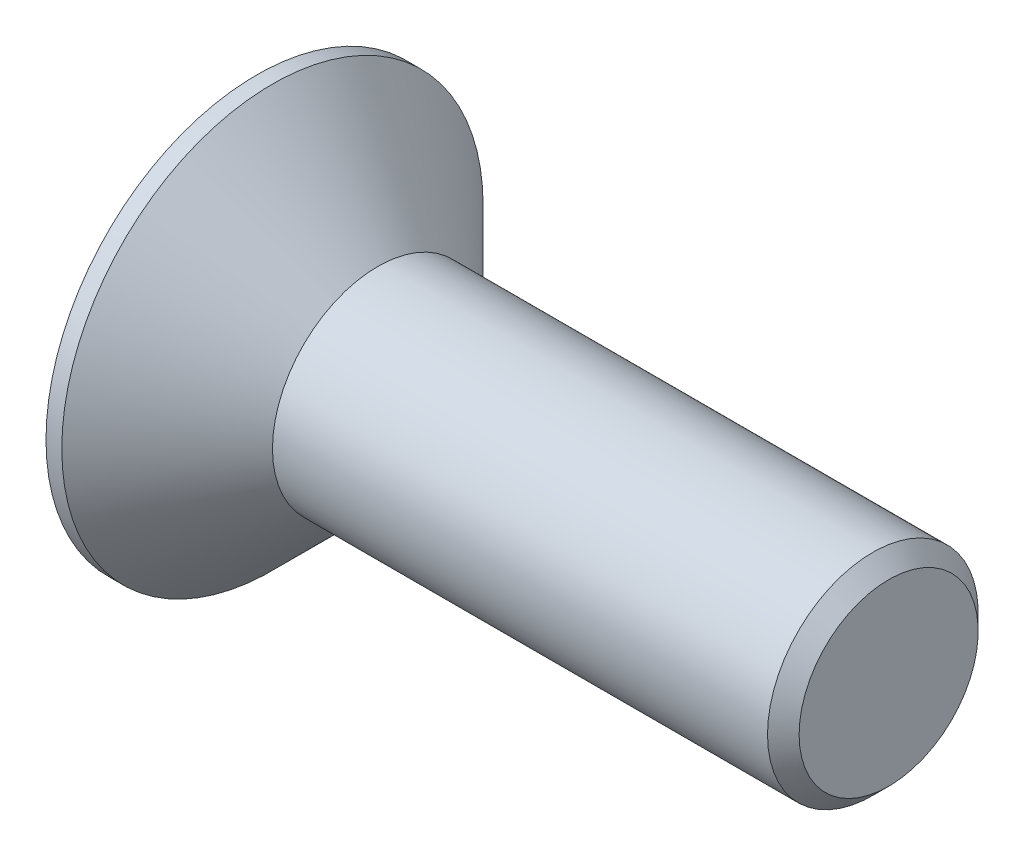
ISO-10303-21;
HEADER;
FILE_DESCRIPTION(('STEP AP214'),'2;1');
FILE_NAME('part.step','',(''),(''),'','','');
FILE_SCHEMA(('AUTOMOTIVE_DESIGN { 1 0 10303 214 1 1 1 1 }'));
ENDSEC;
DATA;
#1=APPLICATION_CONTEXT('core data for automotive mechanical design processes');
#2=APPLICATION_PROTOCOL_DEFINITION('international standard','automotive_design',2000,#1);
#3=PRODUCT_CONTEXT('',#1,'mechanical');
#4=PRODUCT('Part','Part','',(#3));
#5=PRODUCT_RELATED_PRODUCT_CATEGORY('part','',(#4));
#6=PRODUCT_DEFINITION_FORMATION('','',#4);
#7=PRODUCT_DEFINITION_CONTEXT('part definition',#1,'design');
#8=PRODUCT_DEFINITION('design','',#6,#7);
#9=PRODUCT_DEFINITION_SHAPE('','',#8);
#10=(LENGTH_UNIT() NAMED_UNIT(*) SI_UNIT(.MILLI.,.METRE.));
#11=(NAMED_UNIT(*) PLANE_ANGLE_UNIT() SI_UNIT($,.RADIAN.));
#12=(NAMED_UNIT(*) SI_UNIT($,.STERADIAN.) SOLID_ANGLE_UNIT());
#13=UNCERTAINTY_MEASURE_WITH_UNIT(LENGTH_MEASURE(1.E-05),#10,'distance_accuracy_value','');
#14=(GEOMETRIC_REPRESENTATION_CONTEXT(3) GLOBAL_UNCERTAINTY_ASSIGNED_CONTEXT((#13)) GLOBAL_UNIT_ASSIGNED_CONTEXT((#10,
#11,#12)) REPRESENTATION_CONTEXT('',''));
#15=CARTESIAN_POINT('',(0.,0.,0.));
#16=DIRECTION('',(0.,0.,1.));
#17=DIRECTION('',(1.,0.,0.));
#18=AXIS2_PLACEMENT_3D('',#15,#16,#17);
#19=CARTESIAN_POINT('',(-148.,44.,11.9999999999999));
#20=DIRECTION('',(-1.,0.,0.));
#21=DIRECTION('',(0.,0.,1.));
#22=AXIS2_PLACEMENT_3D('',#19,#20,#21);
#23=PLANE('',#22);
#24=CARTESIAN_POINT('',(-148.,44.,11.9999999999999));
#25=DIRECTION('',(-1.,0.,0.));
#26=DIRECTION('',(0.,0.,1.));
#27=AXIS2_PLACEMENT_3D('',#24,#25,#26);
#28=CIRCLE('',#27,4.);
#29=CARTESIAN_POINT('',(-148.,44.,15.9999999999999));
#30=VERTEX_POINT('',#29);
#31=EDGE_CURVE('E11',#30,#30,#28,.T.);
#32=ORIENTED_EDGE('',*,*,#31,.T.);
#33=EDGE_LOOP('',(#32));
#34=FACE_BOUND('',#33,.T.);
#35=DIRECTION('',(0.,0.,1.));
#36=VECTOR('',#35,1.);
#37=CARTESIAN_POINT('',(-148.,45.2499994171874,11.2783124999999));
#38=LINE('',#37,#36);
#39=CARTESIAN_POINT('',(-148.,45.2499994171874,11.2783124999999));
#40=VERTEX_POINT('',#39);
#41=CARTESIAN_POINT('',(-148.,45.2499994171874,12.7216874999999));
#42=VERTEX_POINT('',#41);
#43=EDGE_CURVE('E91',#40,#42,#38,.T.);
#44=ORIENTED_EDGE('',*,*,#43,.T.);
#45=DIRECTION('',(0.,-0.866025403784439,0.5));
#46=VECTOR('',#45,1.);
#47=CARTESIAN_POINT('',(-148.,45.2499994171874,12.7216874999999));
#48=LINE('',#47,#46);
#49=CARTESIAN_POINT('',(-148.,44.,13.4433749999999));
#50=VERTEX_POINT('',#49);
#51=EDGE_CURVE('E30',#42,#50,#48,.T.);
#52=ORIENTED_EDGE('',*,*,#51,.T.);
#53=DIRECTION('',(0.,-0.866025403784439,-0.5));
#54=VECTOR('',#53,1.);
#55=CARTESIAN_POINT('',(-148.,44.,13.4433749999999));
#56=LINE('',#55,#54);
#57=CARTESIAN_POINT('',(-148.,42.7500005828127,12.7216874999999));
#58=VERTEX_POINT('',#57);
#59=EDGE_CURVE('E168',#50,#58,#56,.T.);
#60=ORIENTED_EDGE('',*,*,#59,.T.);
#61=DIRECTION('',(0.,0.,-1.));
#62=VECTOR('',#61,1.);
#63=CARTESIAN_POINT('',(-148.,42.7500005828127,12.7216874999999));
#64=LINE('',#63,#62);
#65=CARTESIAN_POINT('',(-148.,42.7500005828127,11.2783124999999));
#66=VERTEX_POINT('',#65);
#67=EDGE_CURVE('E164',#58,#66,#64,.T.);
#68=ORIENTED_EDGE('',*,*,#67,.T.);
#69=DIRECTION('',(0.,0.866025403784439,-0.5));
#70=VECTOR('',#69,1.);
#71=CARTESIAN_POINT('',(-148.,42.7500005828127,11.2783124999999));
#72=LINE('',#71,#70);
#73=CARTESIAN_POINT('',(-148.,44.,10.5566249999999));
#74=VERTEX_POINT('',#73);
#75=EDGE_CURVE('E159',#66,#74,#72,.T.);
#76=ORIENTED_EDGE('',*,*,#75,.T.);
#77=DIRECTION('',(0.,0.866025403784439,0.5));
#78=VECTOR('',#77,1.);
#79=CARTESIAN_POINT('',(-148.,44.,10.5566249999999));
#80=LINE('',#79,#78);
#81=EDGE_CURVE('E95',#74,#40,#80,.T.);
#82=ORIENTED_EDGE('',*,*,#81,.T.);
#83=EDGE_LOOP('',(#44,#52,#60,#68,#76,#82));
#84=FACE_BOUND('',#83,.T.);
#85=ADVANCED_FACE('F16',(#34,#84),#23,.T.);
#86=CARTESIAN_POINT('',(-148.,44.,11.9999999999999));
#87=DIRECTION('',(-1.,0.,0.));
#88=DIRECTION('',(0.,0.,1.));
#89=AXIS2_PLACEMENT_3D('',#86,#87,#88);
#90=CYLINDRICAL_SURFACE('',#89,4.);
#91=ORIENTED_EDGE('',*,*,#31,.F.);
#92=EDGE_LOOP('',(#91));
#93=FACE_BOUND('',#92,.T.);
#94=CARTESIAN_POINT('',(-147.7,44.,11.9999999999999));
#95=DIRECTION('',(-1.,0.,0.));
#96=DIRECTION('',(0.,0.,1.));
#97=AXIS2_PLACEMENT_3D('',#94,#95,#96);
#98=CIRCLE('',#97,4.);
#99=CARTESIAN_POINT('',(-147.7,44.,15.9999999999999));
#100=VERTEX_POINT('',#99);
#101=EDGE_CURVE('E23',#100,#100,#98,.T.);
#102=ORIENTED_EDGE('',*,*,#101,.T.);
#103=EDGE_LOOP('',(#102));
#104=FACE_BOUND('',#103,.T.);
#105=ADVANCED_FACE('F117',(#93,#104),#90,.T.);
#106=CARTESIAN_POINT('',(-145.7,44.,11.9999999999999));
#107=DIRECTION('',(-1.,0.,0.));
#108=DIRECTION('',(0.,0.,1.));
#109=AXIS2_PLACEMENT_3D('',#106,#107,#108);
#110=CONICAL_SURFACE('',#109,2.,0.785398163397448);
#111=ORIENTED_EDGE('',*,*,#101,.F.);
#112=EDGE_LOOP('',(#111));
#113=FACE_BOUND('',#112,.T.);
#114=CARTESIAN_POINT('',(-145.7,44.,11.9999999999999));
#115=DIRECTION('',(-1.,0.,0.));
#116=DIRECTION('',(0.,0.,1.));
#117=AXIS2_PLACEMENT_3D('',#114,#115,#116);
#118=CIRCLE('',#117,2.);
#119=CARTESIAN_POINT('',(-145.7,44.,13.9999999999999));
#120=VERTEX_POINT('',#119);
#121=EDGE_CURVE('E112',#120,#120,#118,.T.);
#122=ORIENTED_EDGE('',*,*,#121,.T.);
#123=EDGE_LOOP('',(#122));
#124=FACE_BOUND('',#123,.T.);
#125=ADVANCED_FACE('F119',(#113,#124),#110,.T.);
#126=CARTESIAN_POINT('',(-148.,44.,11.9999999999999));
#127=DIRECTION('',(-1.,0.,0.));
#128=DIRECTION('',(0.,0.,1.));
#129=AXIS2_PLACEMENT_3D('',#126,#127,#128);
#130=CYLINDRICAL_SURFACE('',#129,2.);
#131=ORIENTED_EDGE('',*,*,#121,.F.);
#132=EDGE_LOOP('',(#131));
#133=FACE_BOUND('',#132,.T.);
#134=CARTESIAN_POINT('',(-136.3,44.,12.));
#135=DIRECTION('',(-1.,0.,0.));
#136=DIRECTION('',(0.,0.,1.));
#137=AXIS2_PLACEMENT_3D('',#134,#135,#136);
#138=CIRCLE('',#137,2.);
#139=CARTESIAN_POINT('',(-136.3,44.,14.));
#140=VERTEX_POINT('',#139);
#141=EDGE_CURVE('E109',#140,#140,#138,.T.);
#142=ORIENTED_EDGE('',*,*,#141,.T.);
#143=EDGE_LOOP('',(#142));
#144=FACE_BOUND('',#143,.T.);
#145=ADVANCED_FACE('F122',(#133,#144),#130,.T.);
#146=CARTESIAN_POINT('',(-136.,44.,12.));
#147=DIRECTION('',(-1.,0.,0.));
#148=DIRECTION('',(0.,0.,1.));
#149=AXIS2_PLACEMENT_3D('',#146,#147,#148);
#150=CONICAL_SURFACE('',#149,1.7,0.785398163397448);
#151=ORIENTED_EDGE('',*,*,#141,.F.);
#152=EDGE_LOOP('',(#151));
#153=FACE_BOUND('',#152,.T.);
#154=CARTESIAN_POINT('',(-136.,44.,12.));
#155=DIRECTION('',(-1.,0.,0.));
#156=DIRECTION('',(0.,0.,1.));
#157=AXIS2_PLACEMENT_3D('',#154,#155,#156);
#158=CIRCLE('',#157,1.7);
#159=CARTESIAN_POINT('',(-136.,44.,13.7));
#160=VERTEX_POINT('',#159);
#161=EDGE_CURVE('E106',#160,#160,#158,.T.);
#162=ORIENTED_EDGE('',*,*,#161,.T.);
#163=EDGE_LOOP('',(#162));
#164=FACE_BOUND('',#163,.T.);
#165=ADVANCED_FACE('F128',(#153,#164),#150,.T.);
#166=CARTESIAN_POINT('',(-136.,44.,12.));
#167=DIRECTION('',(-1.,0.,0.));
#168=DIRECTION('',(0.,0.,1.));
#169=AXIS2_PLACEMENT_3D('',#166,#167,#168);
#170=PLANE('',#169);
#171=ORIENTED_EDGE('',*,*,#161,.F.);
#172=EDGE_LOOP('',(#171));
#173=FACE_BOUND('',#172,.T.);
#174=ADVANCED_FACE('F134',(#173),#170,.F.);
#175=CARTESIAN_POINT('',(-145.166667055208,45.2499994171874,12.7216874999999));
#176=DIRECTION('',(0.,-0.5,-0.866025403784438));
#177=DIRECTION('',(0.,0.866025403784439,-0.5));
#178=AXIS2_PLACEMENT_3D('',#175,#176,#177);
#179=PLANE('',#178);
#180=DIRECTION('',(-1.,0.,0.));
#181=VECTOR('',#180,1.);
#182=CARTESIAN_POINT('',(-145.166667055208,44.,13.4433749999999));
#183=LINE('',#182,#181);
#184=CARTESIAN_POINT('',(-146.,44.,13.4433749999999));
#185=VERTEX_POINT('',#184);
#186=EDGE_CURVE('E104',#185,#50,#183,.T.);
#187=ORIENTED_EDGE('',*,*,#186,.T.);
#188=ORIENTED_EDGE('',*,*,#51,.F.);
#189=DIRECTION('',(-1.,0.,0.));
#190=VECTOR('',#189,1.);
#191=CARTESIAN_POINT('',(-145.166667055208,45.2499994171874,12.7216874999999));
#192=LINE('',#191,#190);
#193=CARTESIAN_POINT('',(-146.,45.2499994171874,12.7216874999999));
#194=VERTEX_POINT('',#193);
#195=EDGE_CURVE('E85',#194,#42,#192,.T.);
#196=ORIENTED_EDGE('',*,*,#195,.F.);
#197=CARTESIAN_POINT('',(-146.000000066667,43.9999998,13.4433751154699));
#198=CARTESIAN_POINT('',(-145.981684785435,44.0549297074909,13.4116613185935));
#199=CARTESIAN_POINT('',(-145.965027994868,44.1103337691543,13.3796737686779));
#200=CARTESIAN_POINT('',(-145.93595406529,44.2221011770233,13.3151448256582));
#201=CARTESIAN_POINT('',(-145.923547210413,44.2784665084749,13.2826022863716));
#202=CARTESIAN_POINT('',(-145.904235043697,44.3904986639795,13.2179204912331));
#203=CARTESIAN_POINT('',(-145.897201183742,44.4461482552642,13.1857911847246));
#204=CARTESIAN_POINT('',(-145.88880578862,44.5577091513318,13.121381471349));
#205=CARTESIAN_POINT('',(-145.887437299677,44.6136200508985,13.0891012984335));
#206=CARTESIAN_POINT('',(-145.890291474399,44.7180835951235,13.0287892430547));
#207=CARTESIAN_POINT('',(-145.893813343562,44.7666519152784,13.0007483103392));
#208=CARTESIAN_POINT('',(-145.904973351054,44.8634721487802,12.9448491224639));
#209=CARTESIAN_POINT('',(-145.9126152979,44.911723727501,12.9169910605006));
#210=CARTESIAN_POINT('',(-145.931718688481,45.0087434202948,12.8609767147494));
#211=CARTESIAN_POINT('',(-145.94326107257,45.0574992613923,12.8328275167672));
#212=CARTESIAN_POINT('',(-145.969457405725,45.154283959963,12.776948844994));
#213=CARTESIAN_POINT('',(-145.984105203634,45.2023140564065,12.7492186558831));
#214=CARTESIAN_POINT('',(-146.000000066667,45.2499996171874,12.7216873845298));
#215=B_SPLINE_CURVE_WITH_KNOTS('',3,(#197,#198,#199,#200,#201,#202,#203,#204,#205,#206,#207,
#208,#209,#210,#211,#212,#213,#214),.UNSPECIFIED.,.F.,.F.,(4,2,2,2,2,2,2,2,4),(0.,
0.198134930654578,0.396745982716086,0.590442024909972,0.783900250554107,0.952317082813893,
1.1208898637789,1.29320078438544,1.46517353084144),.UNSPECIFIED.);
#216=EDGE_CURVE('E78',#185,#194,#215,.T.);
#217=ORIENTED_EDGE('',*,*,#216,.F.);
#218=EDGE_LOOP('',(#187,#188,#196,#217));
#219=FACE_BOUND('',#218,.T.);
#220=ADVANCED_FACE('F86',(#219),#179,.T.);
#221=CARTESIAN_POINT('',(-145.166667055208,44.,13.4433749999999));
#222=DIRECTION('',(0.,0.5,-0.866025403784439));
#223=DIRECTION('',(0.,0.866025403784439,0.5));
#224=AXIS2_PLACEMENT_3D('',#221,#222,#223);
#225=PLANE('',#224);
#226=DIRECTION('',(-1.,0.,0.));
#227=VECTOR('',#226,1.);
#228=CARTESIAN_POINT('',(-145.166667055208,42.7500005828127,12.7216874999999));
#229=LINE('',#228,#227);
#230=CARTESIAN_POINT('',(-146.,42.7500005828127,12.7216874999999));
#231=VERTEX_POINT('',#230);
#232=EDGE_CURVE('E102',#231,#58,#229,.T.);
#233=ORIENTED_EDGE('',*,*,#232,.T.);
#234=ORIENTED_EDGE('',*,*,#59,.F.);
#235=ORIENTED_EDGE('',*,*,#186,.F.);
#236=CARTESIAN_POINT('',(-146.000000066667,42.7500003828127,12.7216873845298));
#237=CARTESIAN_POINT('',(-145.981684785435,42.8049302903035,12.7534011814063));
#238=CARTESIAN_POINT('',(-145.965027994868,42.860334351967,12.7853887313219));
#239=CARTESIAN_POINT('',(-145.93595406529,42.9721017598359,12.8499176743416));
#240=CARTESIAN_POINT('',(-145.923547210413,43.0284670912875,12.8824602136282));
#241=CARTESIAN_POINT('',(-145.904235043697,43.1404992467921,12.9471420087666));
#242=CARTESIAN_POINT('',(-145.897201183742,43.1961488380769,12.9792713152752));
#243=CARTESIAN_POINT('',(-145.88880578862,43.3077097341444,13.0436810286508));
#244=CARTESIAN_POINT('',(-145.887437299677,43.3636206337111,13.0759612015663));
#245=CARTESIAN_POINT('',(-145.890291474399,43.4680841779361,13.1362732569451));
#246=CARTESIAN_POINT('',(-145.893813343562,43.516652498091,13.1643141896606));
#247=CARTESIAN_POINT('',(-145.904973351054,43.6134727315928,13.2202133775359));
#248=CARTESIAN_POINT('',(-145.9126152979,43.6617243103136,13.2480714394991));
#249=CARTESIAN_POINT('',(-145.931718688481,43.7587440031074,13.3040857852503));
#250=CARTESIAN_POINT('',(-145.94326107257,43.8074998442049,13.3322349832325));
#251=CARTESIAN_POINT('',(-145.969457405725,43.9042845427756,13.3881136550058));
#252=CARTESIAN_POINT('',(-145.984105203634,43.9523146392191,13.4158438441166));
#253=CARTESIAN_POINT('',(-146.000000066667,44.0000002,13.4433751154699));
#254=B_SPLINE_CURVE_WITH_KNOTS('',3,(#236,#237,#238,#239,#240,#241,#242,#243,#244,#245,#246,
#247,#248,#249,#250,#251,#252,#253),.UNSPECIFIED.,.F.,.F.,(4,2,2,2,2,2,2,2,4),(0.,
0.198134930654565,0.396745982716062,0.590442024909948,0.783900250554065,0.952317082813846,
1.12088986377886,1.2932007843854,1.46517353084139),.UNSPECIFIED.);
#255=EDGE_CURVE('E82',#231,#185,#254,.T.);
#256=ORIENTED_EDGE('',*,*,#255,.F.);
#257=EDGE_LOOP('',(#233,#234,#235,#256));
#258=FACE_BOUND('',#257,.T.);
#259=ADVANCED_FACE('F144',(#258),#225,.T.);
#260=CARTESIAN_POINT('',(-145.166667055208,42.7500005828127,12.7216874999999));
#261=DIRECTION('',(0.,1.,0.));
#262=DIRECTION('',(0.,0.,1.));
#263=AXIS2_PLACEMENT_3D('',#260,#261,#262);
#264=PLANE('',#263);
#265=DIRECTION('',(-1.,0.,0.));
#266=VECTOR('',#265,1.);
#267=CARTESIAN_POINT('',(-145.166667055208,42.7500005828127,11.2783124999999));
#268=LINE('',#267,#266);
#269=CARTESIAN_POINT('',(-146.,42.7500005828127,11.2783124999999));
#270=VERTEX_POINT('',#269);
#271=EDGE_CURVE('E100',#270,#66,#268,.T.);
#272=ORIENTED_EDGE('',*,*,#271,.T.);
#273=ORIENTED_EDGE('',*,*,#67,.F.);
#274=ORIENTED_EDGE('',*,*,#232,.F.);
#275=CARTESIAN_POINT('',(-146.464793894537,42.7500005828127,10.131069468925));
#276=CARTESIAN_POINT('',(-146.438896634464,42.7500005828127,10.1850488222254));
#277=CARTESIAN_POINT('',(-146.413268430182,42.7500005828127,10.2391595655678));
#278=CARTESIAN_POINT('',(-146.362702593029,42.7500005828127,10.3477141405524));
#279=CARTESIAN_POINT('',(-146.337765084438,42.7500005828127,10.4021580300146));
#280=CARTESIAN_POINT('',(-146.288593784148,42.7500005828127,10.5117613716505));
#281=CARTESIAN_POINT('',(-146.26436517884,42.7500005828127,10.5669231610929));
#282=CARTESIAN_POINT('',(-146.216994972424,42.7500005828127,10.6777087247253));
#283=CARTESIAN_POINT('',(-146.193853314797,42.7500005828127,10.7333324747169));
#284=CARTESIAN_POINT('',(-146.148354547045,42.7500005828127,10.8465996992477));
#285=CARTESIAN_POINT('',(-146.126033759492,42.7500005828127,10.904257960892));
#286=CARTESIAN_POINT('',(-146.0832554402,42.7500005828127,11.0202593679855));
#287=CARTESIAN_POINT('',(-146.062798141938,42.7500005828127,11.0786025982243));
#288=CARTESIAN_POINT('',(-146.005084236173,42.7500005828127,11.2545648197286));
#289=CARTESIAN_POINT('',(-145.971350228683,42.7500005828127,11.3734383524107));
#290=CARTESIAN_POINT('',(-145.932220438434,42.7500005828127,11.5541271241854));
#291=CARTESIAN_POINT('',(-145.9210940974,42.7500005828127,11.6146954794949));
#292=CARTESIAN_POINT('',(-145.903427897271,42.7500005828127,11.7365135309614));
#293=CARTESIAN_POINT('',(-145.896887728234,42.7500005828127,11.7977631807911));
#294=CARTESIAN_POINT('',(-145.888998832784,42.7500005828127,11.9198675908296));
#295=CARTESIAN_POINT('',(-145.887588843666,42.7500005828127,11.9807182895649));
#296=CARTESIAN_POINT('',(-145.88991623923,42.7500005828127,12.1023191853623));
#297=CARTESIAN_POINT('',(-145.893653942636,42.7500005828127,12.1630693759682));
#298=CARTESIAN_POINT('',(-145.908898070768,42.7500005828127,12.3129614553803));
#299=CARTESIAN_POINT('',(-145.923261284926,42.7500005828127,12.4018128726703));
#300=CARTESIAN_POINT('',(-145.960299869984,42.7500005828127,12.5777878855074));
#301=CARTESIAN_POINT('',(-145.982985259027,42.7500005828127,12.6649092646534));
#302=CARTESIAN_POINT('',(-146.021737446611,42.7500005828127,12.7952088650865));
#303=CARTESIAN_POINT('',(-146.035622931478,42.7500005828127,12.8390606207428));
#304=CARTESIAN_POINT('',(-146.064678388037,42.7500005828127,12.9263076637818));
#305=CARTESIAN_POINT('',(-146.079847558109,42.7500005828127,12.9697032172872));
#306=CARTESIAN_POINT('',(-146.111250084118,42.7500005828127,13.0560958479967));
#307=CARTESIAN_POINT('',(-146.127483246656,42.7500005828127,13.0990929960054));
#308=CARTESIAN_POINT('',(-146.160838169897,42.7500005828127,13.184748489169));
#309=CARTESIAN_POINT('',(-146.177960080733,42.7500005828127,13.2274067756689));
#310=CARTESIAN_POINT('',(-146.222761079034,42.7500005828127,13.3362933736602));
#311=CARTESIAN_POINT('',(-146.250968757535,42.7500005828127,13.4023039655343));
#312=CARTESIAN_POINT('',(-146.308743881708,42.7500005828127,13.533729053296));
#313=CARTESIAN_POINT('',(-146.338311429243,42.7500005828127,13.5991435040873));
#314=CARTESIAN_POINT('',(-146.428574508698,42.7500005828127,13.7946912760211));
#315=CARTESIAN_POINT('',(-146.49082122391,42.7500005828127,13.9241071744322));
#316=CARTESIAN_POINT('',(-146.617925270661,42.7500005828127,14.1818333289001));
#317=CARTESIAN_POINT('',(-146.682785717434,42.7500005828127,14.3101420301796));
#318=CARTESIAN_POINT('',(-146.814174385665,42.7500005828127,14.5658803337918));
#319=CARTESIAN_POINT('',(-146.880702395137,42.7500005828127,14.6933100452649));
#320=CARTESIAN_POINT('',(-147.008573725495,42.7500005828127,14.9355621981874));
#321=CARTESIAN_POINT('',(-147.06981373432,42.7500005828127,15.0504393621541));
#322=CARTESIAN_POINT('',(-147.192991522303,42.7500005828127,15.2798241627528));
#323=CARTESIAN_POINT('',(-147.254929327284,42.7500005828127,15.3943317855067));
#324=CARTESIAN_POINT('',(-147.379169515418,42.7500005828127,15.622771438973));
#325=CARTESIAN_POINT('',(-147.441470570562,42.7500005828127,15.7367041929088));
#326=CARTESIAN_POINT('',(-147.566478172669,42.7500005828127,15.9643393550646));
#327=CARTESIAN_POINT('',(-147.629184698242,42.7500005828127,16.0780417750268));
#328=CARTESIAN_POINT('',(-147.692039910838,42.7500005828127,16.1916614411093));
#329=B_SPLINE_CURVE_WITH_KNOTS('',3,(#275,#276,#277,#278,#279,#280,#281,#282,#283,#284,#285,
#286,#287,#288,#289,#290,#291,#292,#293,#294,#295,#296,#297,#298,#299,#300,#301,#302,#303,#304,
#305,#306,#307,#308,#309,#310,#311,#312,#313,#314,#315,#316,#317,#318,#319,#320,#321,#322,#323,
#324,#325,#326,#327,#328),.UNSPECIFIED.,.F.,.F.,(4,2,2,2,2,2,2,2,2,2,2,2,2,2,2,2,2,2,2,2,2,2,2,
2,2,2,4),(0.,0.179612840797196,0.35925779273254,0.539992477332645,0.720717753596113,
0.906167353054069,1.09164015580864,1.46153946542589,1.64614477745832,1.83073761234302,
2.01311873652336,2.19551115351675,2.46497183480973,2.73475796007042,2.87273569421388,
3.01062789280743,3.14849509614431,3.28638566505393,3.50171814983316,3.71706679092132,
4.14783519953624,4.57913316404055,5.01037657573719,5.40091694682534,5.79147181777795,
6.18103330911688,6.57057441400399),.UNSPECIFIED.);
#330=EDGE_CURVE('E204',#270,#231,#329,.T.);
#331=ORIENTED_EDGE('',*,*,#330,.F.);
#332=EDGE_LOOP('',(#272,#273,#274,#331));
#333=FACE_BOUND('',#332,.T.);
#334=ADVANCED_FACE('F209',(#333),#264,.T.);
#335=CARTESIAN_POINT('',(-145.166667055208,42.7500005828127,11.2783124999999));
#336=DIRECTION('',(0.,0.5,0.866025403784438));
#337=DIRECTION('',(0.,-0.866025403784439,0.5));
#338=AXIS2_PLACEMENT_3D('',#335,#336,#337);
#339=PLANE('',#338);
#340=DIRECTION('',(-1.,0.,0.));
#341=VECTOR('',#340,1.);
#342=CARTESIAN_POINT('',(-145.166667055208,44.,10.5566249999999));
#343=LINE('',#342,#341);
#344=CARTESIAN_POINT('',(-146.,44.,10.5566249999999));
#345=VERTEX_POINT('',#344);
#346=EDGE_CURVE('E93',#345,#74,#343,.T.);
#347=ORIENTED_EDGE('',*,*,#346,.T.);
#348=ORIENTED_EDGE('',*,*,#75,.F.);
#349=ORIENTED_EDGE('',*,*,#271,.F.);
#350=CARTESIAN_POINT('',(-146.000000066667,44.0000002,10.5566248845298));
#351=CARTESIAN_POINT('',(-145.981684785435,43.9450702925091,10.5883386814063));
#352=CARTESIAN_POINT('',(-145.965027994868,43.8896662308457,10.6203262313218));
#353=CARTESIAN_POINT('',(-145.93595406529,43.7778988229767,10.6848551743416));
#354=CARTESIAN_POINT('',(-145.923547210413,43.7215334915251,10.7173977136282));
#355=CARTESIAN_POINT('',(-145.904235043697,43.6095013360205,10.7820795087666));
#356=CARTESIAN_POINT('',(-145.897201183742,43.5538517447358,10.8142088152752));
#357=CARTESIAN_POINT('',(-145.88880578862,43.4422908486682,10.8786185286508));
#358=CARTESIAN_POINT('',(-145.887437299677,43.3863799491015,10.9108987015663));
#359=CARTESIAN_POINT('',(-145.890291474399,43.2819164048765,10.9712107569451));
#360=CARTESIAN_POINT('',(-145.893813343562,43.2333480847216,10.9992516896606));
#361=CARTESIAN_POINT('',(-145.904973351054,43.1365278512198,11.0551508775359));
#362=CARTESIAN_POINT('',(-145.9126152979,43.0882762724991,11.0830089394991));
#363=CARTESIAN_POINT('',(-145.931718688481,42.9912565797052,11.1390232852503));
#364=CARTESIAN_POINT('',(-145.94326107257,42.9425007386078,11.1671724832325));
#365=CARTESIAN_POINT('',(-145.969457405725,42.8457160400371,11.2230511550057));
#366=CARTESIAN_POINT('',(-145.984105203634,42.7976859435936,11.2507813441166));
#367=CARTESIAN_POINT('',(-146.000000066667,42.7500003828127,11.2783126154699));
#368=B_SPLINE_CURVE_WITH_KNOTS('',3,(#350,#351,#352,#353,#354,#355,#356,#357,#358,#359,#360,
#361,#362,#363,#364,#365,#366,#367),.UNSPECIFIED.,.F.,.F.,(4,2,2,2,2,2,2,2,4),(0.,
0.198134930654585,0.396745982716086,0.590442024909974,0.783900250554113,0.952317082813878,
1.12088986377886,1.2932007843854,1.46517353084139),.UNSPECIFIED.);
#369=EDGE_CURVE('E199',#345,#270,#368,.T.);
#370=ORIENTED_EDGE('',*,*,#369,.F.);
#371=EDGE_LOOP('',(#347,#348,#349,#370));
#372=FACE_BOUND('',#371,.T.);
#373=ADVANCED_FACE('F212',(#372),#339,.T.);
#374=CARTESIAN_POINT('',(-145.166667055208,44.,10.5566249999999));
#375=DIRECTION('',(0.,-0.5,0.866025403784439));
#376=DIRECTION('',(0.,-0.866025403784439,-0.5));
#377=AXIS2_PLACEMENT_3D('',#374,#375,#376);
#378=PLANE('',#377);
#379=DIRECTION('',(-1.,0.,0.));
#380=VECTOR('',#379,1.);
#381=CARTESIAN_POINT('',(-145.166667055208,45.2499994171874,11.2783124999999));
#382=LINE('',#381,#380);
#383=CARTESIAN_POINT('',(-146.,45.2499994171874,11.2783124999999));
#384=VERTEX_POINT('',#383);
#385=EDGE_CURVE('E90',#384,#40,#382,.T.);
#386=ORIENTED_EDGE('',*,*,#385,.T.);
#387=ORIENTED_EDGE('',*,*,#81,.F.);
#388=ORIENTED_EDGE('',*,*,#346,.F.);
#389=CARTESIAN_POINT('',(-146.000000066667,45.2499996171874,11.2783126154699));
#390=CARTESIAN_POINT('',(-145.981684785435,45.1950697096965,11.2465988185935));
#391=CARTESIAN_POINT('',(-145.965027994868,45.139665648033,11.2146112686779));
#392=CARTESIAN_POINT('',(-145.93595406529,45.0278982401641,11.1500823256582));
#393=CARTESIAN_POINT('',(-145.923547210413,44.9715329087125,11.1175397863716));
#394=CARTESIAN_POINT('',(-145.904235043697,44.8595007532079,11.0528579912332));
#395=CARTESIAN_POINT('',(-145.897201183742,44.8038511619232,11.0207286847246));
#396=CARTESIAN_POINT('',(-145.88880578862,44.6922902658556,10.956318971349));
#397=CARTESIAN_POINT('',(-145.887437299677,44.6363793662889,10.9240387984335));
#398=CARTESIAN_POINT('',(-145.890291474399,44.5319158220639,10.8637267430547));
#399=CARTESIAN_POINT('',(-145.893813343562,44.483347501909,10.8356858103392));
#400=CARTESIAN_POINT('',(-145.904973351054,44.3865272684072,10.7797866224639));
#401=CARTESIAN_POINT('',(-145.9126152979,44.3382756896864,10.7519285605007));
#402=CARTESIAN_POINT('',(-145.931718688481,44.2412559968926,10.6959142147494));
#403=CARTESIAN_POINT('',(-145.94326107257,44.1925001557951,10.6677650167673));
#404=CARTESIAN_POINT('',(-145.969457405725,44.0957154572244,10.611886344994));
#405=CARTESIAN_POINT('',(-145.984105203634,44.0476853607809,10.5841561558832));
#406=CARTESIAN_POINT('',(-146.000000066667,43.9999998,10.5566248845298));
#407=B_SPLINE_CURVE_WITH_KNOTS('',3,(#389,#390,#391,#392,#393,#394,#395,#396,#397,#398,#399,
#400,#401,#402,#403,#404,#405,#406),.UNSPECIFIED.,.F.,.F.,(4,2,2,2,2,2,2,2,4),(0.,
0.198134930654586,0.396745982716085,0.590442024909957,0.783900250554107,0.952317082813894,
1.1208898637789,1.29320078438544,1.46517353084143),.UNSPECIFIED.);
#408=EDGE_CURVE('E38',#384,#345,#407,.T.);
#409=ORIENTED_EDGE('',*,*,#408,.F.);
#410=EDGE_LOOP('',(#386,#387,#388,#409));
#411=FACE_BOUND('',#410,.T.);
#412=ADVANCED_FACE('F158',(#411),#378,.T.);
#413=CARTESIAN_POINT('',(-145.166667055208,45.2499994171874,11.2783124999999));
#414=DIRECTION('',(0.,-1.,0.));
#415=DIRECTION('',(0.,0.,-1.));
#416=AXIS2_PLACEMENT_3D('',#413,#414,#415);
#417=PLANE('',#416);
#418=ORIENTED_EDGE('',*,*,#195,.T.);
#419=ORIENTED_EDGE('',*,*,#43,.F.);
#420=ORIENTED_EDGE('',*,*,#385,.F.);
#421=CARTESIAN_POINT('',(-146.464793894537,45.2499994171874,10.131069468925));
#422=CARTESIAN_POINT('',(-146.438896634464,45.2499994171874,10.1850488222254));
#423=CARTESIAN_POINT('',(-146.413268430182,45.2499994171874,10.2391595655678));
#424=CARTESIAN_POINT('',(-146.362702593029,45.2499994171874,10.3477141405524));
#425=CARTESIAN_POINT('',(-146.337765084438,45.2499994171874,10.4021580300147));
#426=CARTESIAN_POINT('',(-146.288593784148,45.2499994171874,10.5117613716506));
#427=CARTESIAN_POINT('',(-146.26436517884,45.2499994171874,10.5669231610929));
#428=CARTESIAN_POINT('',(-146.216994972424,45.2499994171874,10.6777087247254));
#429=CARTESIAN_POINT('',(-146.193853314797,45.2499994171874,10.7333324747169));
#430=CARTESIAN_POINT('',(-146.148354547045,45.2499994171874,10.8465996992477));
#431=CARTESIAN_POINT('',(-146.126033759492,45.2499994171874,10.904257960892));
#432=CARTESIAN_POINT('',(-146.0832554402,45.2499994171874,11.0202593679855));
#433=CARTESIAN_POINT('',(-146.062798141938,45.2499994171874,11.0786025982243));
#434=CARTESIAN_POINT('',(-146.005084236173,45.2499994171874,11.2545648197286));
#435=CARTESIAN_POINT('',(-145.971350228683,45.2499994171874,11.3734383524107));
#436=CARTESIAN_POINT('',(-145.932220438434,45.2499994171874,11.5541271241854));
#437=CARTESIAN_POINT('',(-145.921094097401,45.2499994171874,11.6146954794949));
#438=CARTESIAN_POINT('',(-145.903427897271,45.2499994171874,11.7365135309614));
#439=CARTESIAN_POINT('',(-145.896887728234,45.2499994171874,11.7977631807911));
#440=CARTESIAN_POINT('',(-145.888998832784,45.2499994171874,11.9198675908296));
#441=CARTESIAN_POINT('',(-145.887588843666,45.2499994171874,11.9807182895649));
#442=CARTESIAN_POINT('',(-145.88991623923,45.2499994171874,12.1023191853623));
#443=CARTESIAN_POINT('',(-145.893653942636,45.2499994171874,12.1630693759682));
#444=CARTESIAN_POINT('',(-145.908898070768,45.2499994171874,12.3129614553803));
#445=CARTESIAN_POINT('',(-145.923261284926,45.2499994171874,12.4018128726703));
#446=CARTESIAN_POINT('',(-145.960299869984,45.2499994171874,12.5777878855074));
#447=CARTESIAN_POINT('',(-145.982985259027,45.2499994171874,12.6649092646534));
#448=CARTESIAN_POINT('',(-146.021737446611,45.2499994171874,12.7952088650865));
#449=CARTESIAN_POINT('',(-146.035622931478,45.2499994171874,12.8390606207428));
#450=CARTESIAN_POINT('',(-146.064678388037,45.2499994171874,12.9263076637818));
#451=CARTESIAN_POINT('',(-146.079847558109,45.2499994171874,12.9697032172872));
#452=CARTESIAN_POINT('',(-146.111250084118,45.2499994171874,13.0560958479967));
#453=CARTESIAN_POINT('',(-146.127483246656,45.2499994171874,13.0990929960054));
#454=CARTESIAN_POINT('',(-146.160838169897,45.2499994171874,13.184748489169));
#455=CARTESIAN_POINT('',(-146.177960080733,45.2499994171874,13.2274067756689));
#456=CARTESIAN_POINT('',(-146.222761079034,45.2499994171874,13.3362933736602));
#457=CARTESIAN_POINT('',(-146.250968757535,45.2499994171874,13.4023039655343));
#458=CARTESIAN_POINT('',(-146.308743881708,45.2499994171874,13.533729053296));
#459=CARTESIAN_POINT('',(-146.338311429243,45.2499994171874,13.5991435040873));
#460=CARTESIAN_POINT('',(-146.428574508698,45.2499994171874,13.7946912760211));
#461=CARTESIAN_POINT('',(-146.49082122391,45.2499994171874,13.9241071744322));
#462=CARTESIAN_POINT('',(-146.617925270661,45.2499994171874,14.1818333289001));
#463=CARTESIAN_POINT('',(-146.682785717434,45.2499994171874,14.3101420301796));
#464=CARTESIAN_POINT('',(-146.814174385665,45.2499994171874,14.5658803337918));
#465=CARTESIAN_POINT('',(-146.880702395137,45.2499994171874,14.6933100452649));
#466=CARTESIAN_POINT('',(-147.008573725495,45.2499994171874,14.9355621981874));
#467=CARTESIAN_POINT('',(-147.06981373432,45.2499994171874,15.0504393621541));
#468=CARTESIAN_POINT('',(-147.192991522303,45.2499994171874,15.2798241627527));
#469=CARTESIAN_POINT('',(-147.254929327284,45.2499994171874,15.3943317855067));
#470=CARTESIAN_POINT('',(-147.379169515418,45.2499994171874,15.6227714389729));
#471=CARTESIAN_POINT('',(-147.441470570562,45.2499994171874,15.7367041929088));
#472=CARTESIAN_POINT('',(-147.566478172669,45.2499994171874,15.9643393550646));
#473=CARTESIAN_POINT('',(-147.629184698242,45.2499994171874,16.0780417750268));
#474=CARTESIAN_POINT('',(-147.692039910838,45.2499994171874,16.1916614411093));
#475=B_SPLINE_CURVE_WITH_KNOTS('',3,(#421,#422,#423,#424,#425,#426,#427,#428,#429,#430,#431,
#432,#433,#434,#435,#436,#437,#438,#439,#440,#441,#442,#443,#444,#445,#446,#447,#448,#449,#450,
#451,#452,#453,#454,#455,#456,#457,#458,#459,#460,#461,#462,#463,#464,#465,#466,#467,#468,#469,
#470,#471,#472,#473,#474),.UNSPECIFIED.,.F.,.F.,(4,2,2,2,2,2,2,2,2,2,2,2,2,2,2,2,2,2,2,2,2,2,2,
2,2,2,4),(0.,0.179612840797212,0.359257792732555,0.539992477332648,0.720717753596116,
0.906167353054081,1.09164015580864,1.46153946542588,1.64614477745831,1.83073761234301,
2.01311873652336,2.19551115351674,2.46497183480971,2.73475796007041,2.87273569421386,
3.0106278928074,3.14849509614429,3.28638566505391,3.50171814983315,3.71706679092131,
4.14783519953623,4.57913316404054,5.01037657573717,5.40091694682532,5.79147181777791,
6.18103330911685,6.57057441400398),.UNSPECIFIED.);
#476=EDGE_CURVE('E79',#194,#384,#475,.F.);
#477=ORIENTED_EDGE('',*,*,#476,.F.);
#478=EDGE_LOOP('',(#418,#419,#420,#477));
#479=FACE_BOUND('',#478,.T.);
#480=ADVANCED_FACE('F74',(#479),#417,.T.);
#481=CARTESIAN_POINT('',(-145.166667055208,44.,11.9999999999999));
#482=DIRECTION('',(-1.,0.,0.));
#483=DIRECTION('',(0.,0.,1.));
#484=AXIS2_PLACEMENT_3D('',#481,#482,#483);
#485=CONICAL_SURFACE('',#484,0.,1.0471975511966);
#486=CARTESIAN_POINT('',(-145.166667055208,44.,11.9999999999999));
#487=VERTEX_POINT('',#486);
#488=VERTEX_LOOP('',#487);
#489=FACE_BOUND('',#488,.T.);
#490=ORIENTED_EDGE('',*,*,#216,.T.);
#491=ORIENTED_EDGE('',*,*,#476,.T.);
#492=ORIENTED_EDGE('',*,*,#408,.T.);
#493=ORIENTED_EDGE('',*,*,#369,.T.);
#494=ORIENTED_EDGE('',*,*,#330,.T.);
#495=ORIENTED_EDGE('',*,*,#255,.T.);
#496=EDGE_LOOP('',(#490,#491,#492,#493,#494,#495));
#497=FACE_BOUND('',#496,.T.);
#498=ADVANCED_FACE('F71',(#489,#497),#485,.F.);
#499=CLOSED_SHELL('',(#85,#105,#125,#145,#165,#174,#220,#259,#334,#373,#412,#480,#498));
#500=MANIFOLD_SOLID_BREP('B1',#499);
#501=ADVANCED_BREP_SHAPE_REPRESENTATION('',(#18,#500),#14);
#502=SHAPE_DEFINITION_REPRESENTATION(#9,#501);
ENDSEC;
END-ISO-10303-21;
